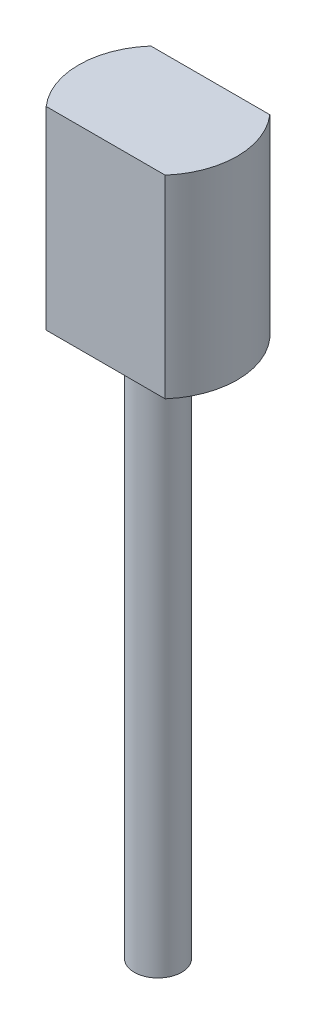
from build123d import *

# Parameters (mm, degrees)
SKETCH1_R           = 3.4798
BOSS_EXTRUDE1_DEPTH = 8.509
SKETCH2_R           = 1.0414
BOSS_EXTRUDE2_DEPTH = 23.749
SKETCH3_OUTSIDE_W   = 15.706
SKETCH3_OUTSIDE_H   = 15.706
CUT_EXTRUDE1_DEPTH  = 8.509


with BuildPart() as part:
    # Sketch1 → Boss-Extrude1 (new body)
    with BuildSketch(Plane(origin=(0, 0, 0), x_dir=(1, 0, 0), z_dir=(0, 1, 0))):
        with Locations(Location((0, 0, 0), (0, 0, 270))):
            Circle(SKETCH1_R)
    extrude(amount=BOSS_EXTRUDE1_DEPTH)

    # Sketch2 → Boss-Extrude2 (add)
    with BuildSketch(Plane.XZ):
        with Locations(Location((0, 0, 0), (0, 0, 90))):
            Circle(SKETCH2_R)
    extrude(amount=BOSS_EXTRUDE2_DEPTH)

    # Sketch3 outside → Cut-Extrude1 (cut)
    with BuildSketch(Plane(origin=(0, 8.509, 0), x_dir=(1, 0, 0), z_dir=(0, 1, 0))):
        Rectangle(SKETCH3_OUTSIDE_W, SKETCH3_OUTSIDE_H)
        with BuildLine():
            Line((-2.612467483, 2.2987), (2.612467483, 2.2987))
            ThreePointArc((2.612467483, 2.2987), (3.4798, 0), (2.612467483, -2.2987))
            Line((2.612467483, -2.2987), (-2.612467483, -2.2987))
            ThreePointArc((-2.612467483, -2.2987), (-3.4798, 0), (-2.612467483, 2.2987))
        make_face(mode=Mode.SUBTRACT)
    extrude(amount=-CUT_EXTRUDE1_DEPTH, mode=Mode.SUBTRACT)


solid = part.part
